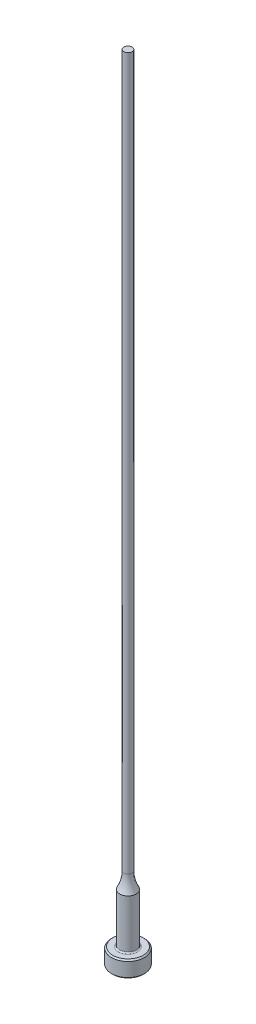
ISO-10303-21;
HEADER;
FILE_DESCRIPTION(('STEP AP214'),'2;1');
FILE_NAME('part.step','',(''),(''),'','','');
FILE_SCHEMA(('AUTOMOTIVE_DESIGN { 1 0 10303 214 1 1 1 1 }'));
ENDSEC;
DATA;
#1=APPLICATION_CONTEXT('core data for automotive mechanical design processes');
#2=APPLICATION_PROTOCOL_DEFINITION('international standard','automotive_design',2000,#1);
#3=PRODUCT_CONTEXT('',#1,'mechanical');
#4=PRODUCT('Part','Part','',(#3));
#5=PRODUCT_RELATED_PRODUCT_CATEGORY('part','',(#4));
#6=PRODUCT_DEFINITION_FORMATION('','',#4);
#7=PRODUCT_DEFINITION_CONTEXT('part definition',#1,'design');
#8=PRODUCT_DEFINITION('design','',#6,#7);
#9=PRODUCT_DEFINITION_SHAPE('','',#8);
#10=(LENGTH_UNIT() NAMED_UNIT(*) SI_UNIT(.MILLI.,.METRE.));
#11=(NAMED_UNIT(*) PLANE_ANGLE_UNIT() SI_UNIT($,.RADIAN.));
#12=(NAMED_UNIT(*) SI_UNIT($,.STERADIAN.) SOLID_ANGLE_UNIT());
#13=UNCERTAINTY_MEASURE_WITH_UNIT(LENGTH_MEASURE(1.E-05),#10,'distance_accuracy_value','');
#14=(GEOMETRIC_REPRESENTATION_CONTEXT(3) GLOBAL_UNCERTAINTY_ASSIGNED_CONTEXT((#13)) GLOBAL_UNIT_ASSIGNED_CONTEXT((#10,
#11,#12)) REPRESENTATION_CONTEXT('',''));
#15=CARTESIAN_POINT('',(0.,0.,0.));
#16=DIRECTION('',(0.,0.,1.));
#17=DIRECTION('',(1.,0.,0.));
#18=AXIS2_PLACEMENT_3D('',#15,#16,#17);
#19=CARTESIAN_POINT('',(-0.793749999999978,152.4,0.));
#20=DIRECTION('',(0.,1.,0.));
#21=DIRECTION('',(0.,0.,1.));
#22=AXIS2_PLACEMENT_3D('',#19,#20,#21);
#23=PLANE('',#22);
#24=CARTESIAN_POINT('',(0.,152.4,0.));
#25=DIRECTION('',(0.,1.,0.));
#26=DIRECTION('',(0.,0.,1.));
#27=AXIS2_PLACEMENT_3D('',#24,#25,#26);
#28=CIRCLE('',#27,0.793749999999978);
#29=CARTESIAN_POINT('',(0.,152.4,0.793749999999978));
#30=VERTEX_POINT('',#29);
#31=EDGE_CURVE('E56',#30,#30,#28,.T.);
#32=ORIENTED_EDGE('',*,*,#31,.T.);
#33=EDGE_LOOP('',(#32));
#34=FACE_BOUND('',#33,.T.);
#35=ADVANCED_FACE('F30',(#34),#23,.T.);
#36=CARTESIAN_POINT('',(0.,259.958771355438,0.));
#37=DIRECTION('',(0.,1.,0.));
#38=DIRECTION('',(0.,0.,1.));
#39=AXIS2_PLACEMENT_3D('',#36,#37,#38);
#40=CYLINDRICAL_SURFACE('',#39,0.793749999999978);
#41=CARTESIAN_POINT('',(0.,15.7741805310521,0.));
#42=DIRECTION('',(0.,1.,0.));
#43=DIRECTION('',(0.,0.,1.));
#44=AXIS2_PLACEMENT_3D('',#41,#42,#43);
#45=CIRCLE('',#44,0.793749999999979);
#46=CARTESIAN_POINT('',(0.,15.7741805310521,0.793749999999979));
#47=VERTEX_POINT('',#46);
#48=EDGE_CURVE('E59',#47,#47,#45,.T.);
#49=ORIENTED_EDGE('',*,*,#48,.T.);
#50=EDGE_LOOP('',(#49));
#51=FACE_BOUND('',#50,.T.);
#52=ORIENTED_EDGE('',*,*,#31,.F.);
#53=EDGE_LOOP('',(#52));
#54=FACE_BOUND('',#53,.T.);
#55=ADVANCED_FACE('F79',(#51,#54),#40,.T.);
#56=CARTESIAN_POINT('',(0.,15.7741805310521,0.));
#57=DIRECTION('',(0.,1.,0.));
#58=DIRECTION('',(0.,0.,1.));
#59=AXIS2_PLACEMENT_3D('',#56,#57,#58);
#60=TOROIDAL_SURFACE('',#59,7.14374999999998,6.35);
#61=CARTESIAN_POINT('',(0.,12.7,0.));
#62=DIRECTION('',(0.,1.,0.));
#63=DIRECTION('',(0.,0.,1.));
#64=AXIS2_PLACEMENT_3D('',#61,#62,#63);
#65=CIRCLE('',#64,1.58749999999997);
#66=CARTESIAN_POINT('',(0.,12.7,1.58749999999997));
#67=VERTEX_POINT('',#66);
#68=EDGE_CURVE('E62',#67,#67,#65,.T.);
#69=ORIENTED_EDGE('',*,*,#68,.T.);
#70=EDGE_LOOP('',(#69));
#71=FACE_BOUND('',#70,.T.);
#72=ORIENTED_EDGE('',*,*,#48,.F.);
#73=EDGE_LOOP('',(#72));
#74=FACE_BOUND('',#73,.T.);
#75=ADVANCED_FACE('F66',(#71,#74),#60,.F.);
#76=CARTESIAN_POINT('',(0.,259.958771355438,0.));
#77=DIRECTION('',(0.,1.,0.));
#78=DIRECTION('',(0.,0.,1.));
#79=AXIS2_PLACEMENT_3D('',#76,#77,#78);
#80=CYLINDRICAL_SURFACE('',#79,1.58749999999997);
#81=CARTESIAN_POINT('',(0.,3.42900000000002,0.));
#82=DIRECTION('',(0.,1.,0.));
#83=DIRECTION('',(0.,0.,1.));
#84=AXIS2_PLACEMENT_3D('',#81,#82,#83);
#85=CIRCLE('',#84,1.58749999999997);
#86=CARTESIAN_POINT('',(0.,3.42900000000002,1.58749999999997));
#87=VERTEX_POINT('',#86);
#88=EDGE_CURVE('E37',#87,#87,#85,.T.);
#89=ORIENTED_EDGE('',*,*,#88,.T.);
#90=EDGE_LOOP('',(#89));
#91=FACE_BOUND('',#90,.T.);
#92=ORIENTED_EDGE('',*,*,#68,.F.);
#93=EDGE_LOOP('',(#92));
#94=FACE_BOUND('',#93,.T.);
#95=ADVANCED_FACE('F69',(#91,#94),#80,.T.);
#96=CARTESIAN_POINT('',(-3.17499999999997,3.175,0.));
#97=DIRECTION('',(0.,1.,0.));
#98=DIRECTION('',(0.,0.,1.));
#99=AXIS2_PLACEMENT_3D('',#96,#97,#98);
#100=PLANE('',#99);
#101=CARTESIAN_POINT('',(0.,3.175,0.));
#102=DIRECTION('',(0.,1.,0.));
#103=DIRECTION('',(0.,0.,1.));
#104=AXIS2_PLACEMENT_3D('',#101,#102,#103);
#105=CIRCLE('',#104,1.84149999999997);
#106=CARTESIAN_POINT('',(0.,3.175,1.84149999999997));
#107=VERTEX_POINT('',#106);
#108=EDGE_CURVE('E10',#107,#107,#105,.F.);
#109=ORIENTED_EDGE('',*,*,#108,.T.);
#110=EDGE_LOOP('',(#109));
#111=FACE_BOUND('',#110,.T.);
#112=CARTESIAN_POINT('',(0.,3.175,0.));
#113=DIRECTION('',(0.,1.,0.));
#114=DIRECTION('',(0.,0.,1.));
#115=AXIS2_PLACEMENT_3D('',#112,#113,#114);
#116=CIRCLE('',#115,2.92099999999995);
#117=CARTESIAN_POINT('',(0.,3.175,2.92099999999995));
#118=VERTEX_POINT('',#117);
#119=EDGE_CURVE('E53',#118,#118,#116,.T.);
#120=ORIENTED_EDGE('',*,*,#119,.T.);
#121=EDGE_LOOP('',(#120));
#122=FACE_BOUND('',#121,.T.);
#123=ADVANCED_FACE('F71',(#111,#122),#100,.T.);
#124=CARTESIAN_POINT('',(0.,259.958771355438,0.));
#125=DIRECTION('',(0.,1.,0.));
#126=DIRECTION('',(0.,0.,1.));
#127=AXIS2_PLACEMENT_3D('',#124,#125,#126);
#128=CYLINDRICAL_SURFACE('',#127,3.17499999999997);
#129=CARTESIAN_POINT('',(0.,2.92100000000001,0.));
#130=DIRECTION('',(0.,1.,0.));
#131=DIRECTION('',(0.,0.,1.));
#132=AXIS2_PLACEMENT_3D('',#129,#130,#131);
#133=CIRCLE('',#132,3.17499999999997);
#134=CARTESIAN_POINT('',(0.,2.92100000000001,3.17499999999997));
#135=VERTEX_POINT('',#134);
#136=EDGE_CURVE('E45',#135,#135,#133,.F.);
#137=ORIENTED_EDGE('',*,*,#136,.T.);
#138=EDGE_LOOP('',(#137));
#139=FACE_BOUND('',#138,.T.);
#140=CARTESIAN_POINT('',(0.,0.254000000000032,0.));
#141=DIRECTION('',(0.,-1.,0.));
#142=DIRECTION('',(0.,0.,-1.));
#143=AXIS2_PLACEMENT_3D('',#140,#141,#142);
#144=CIRCLE('',#143,3.17499999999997);
#145=CARTESIAN_POINT('',(0.,0.254000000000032,-3.17499999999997));
#146=VERTEX_POINT('',#145);
#147=EDGE_CURVE('E50',#146,#146,#144,.F.);
#148=ORIENTED_EDGE('',*,*,#147,.T.);
#149=EDGE_LOOP('',(#148));
#150=FACE_BOUND('',#149,.T.);
#151=ADVANCED_FACE('F77',(#139,#150),#128,.T.);
#152=CARTESIAN_POINT('',(0.,0.,0.));
#153=DIRECTION('',(0.,-1.,0.));
#154=DIRECTION('',(0.,0.,-1.));
#155=AXIS2_PLACEMENT_3D('',#152,#153,#154);
#156=PLANE('',#155);
#157=CARTESIAN_POINT('',(0.,0.,0.));
#158=DIRECTION('',(0.,-1.,0.));
#159=DIRECTION('',(0.,0.,-1.));
#160=AXIS2_PLACEMENT_3D('',#157,#158,#159);
#161=CIRCLE('',#160,2.92099999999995);
#162=CARTESIAN_POINT('',(0.,0.,-2.92099999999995));
#163=VERTEX_POINT('',#162);
#164=EDGE_CURVE('E41',#163,#163,#161,.T.);
#165=ORIENTED_EDGE('',*,*,#164,.T.);
#166=EDGE_LOOP('',(#165));
#167=FACE_BOUND('',#166,.T.);
#168=ADVANCED_FACE('F93',(#167),#156,.T.);
#169=CARTESIAN_POINT('',(0.,3.17499999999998,0.));
#170=DIRECTION('',(0.,-1.,0.));
#171=DIRECTION('',(0.,0.,-1.));
#172=AXIS2_PLACEMENT_3D('',#169,#170,#171);
#173=CONICAL_SURFACE('',#172,2.92099999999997,0.7853981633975);
#174=ORIENTED_EDGE('',*,*,#136,.F.);
#175=EDGE_LOOP('',(#174));
#176=FACE_BOUND('',#175,.T.);
#177=ORIENTED_EDGE('',*,*,#119,.F.);
#178=EDGE_LOOP('',(#177));
#179=FACE_BOUND('',#178,.T.);
#180=ADVANCED_FACE('F90',(#176,#179),#173,.T.);
#181=CARTESIAN_POINT('',(0.,0.254000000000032,0.));
#182=DIRECTION('',(0.,1.,0.));
#183=DIRECTION('',(0.,0.,1.));
#184=AXIS2_PLACEMENT_3D('',#181,#182,#183);
#185=CONICAL_SURFACE('',#184,3.17499999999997,0.785398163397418);
#186=ORIENTED_EDGE('',*,*,#164,.F.);
#187=EDGE_LOOP('',(#186));
#188=FACE_BOUND('',#187,.T.);
#189=ORIENTED_EDGE('',*,*,#147,.F.);
#190=EDGE_LOOP('',(#189));
#191=FACE_BOUND('',#190,.T.);
#192=ADVANCED_FACE('F92',(#188,#191),#185,.T.);
#193=CARTESIAN_POINT('',(0.,3.42900000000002,0.));
#194=DIRECTION('',(0.,1.,0.));
#195=DIRECTION('',(0.,0.,1.));
#196=AXIS2_PLACEMENT_3D('',#193,#194,#195);
#197=TOROIDAL_SURFACE('',#196,1.84149999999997,0.254);
#198=ORIENTED_EDGE('',*,*,#108,.F.);
#199=EDGE_LOOP('',(#198));
#200=FACE_BOUND('',#199,.T.);
#201=ORIENTED_EDGE('',*,*,#88,.F.);
#202=EDGE_LOOP('',(#201));
#203=FACE_BOUND('',#202,.T.);
#204=ADVANCED_FACE('F32',(#200,#203),#197,.F.);
#205=CLOSED_SHELL('',(#35,#55,#75,#95,#123,#151,#168,#180,#192,#204));
#206=MANIFOLD_SOLID_BREP('B2',#205);
#207=ADVANCED_BREP_SHAPE_REPRESENTATION('',(#18,#206),#14);
#208=SHAPE_DEFINITION_REPRESENTATION(#9,#207);
ENDSEC;
END-ISO-10303-21;
